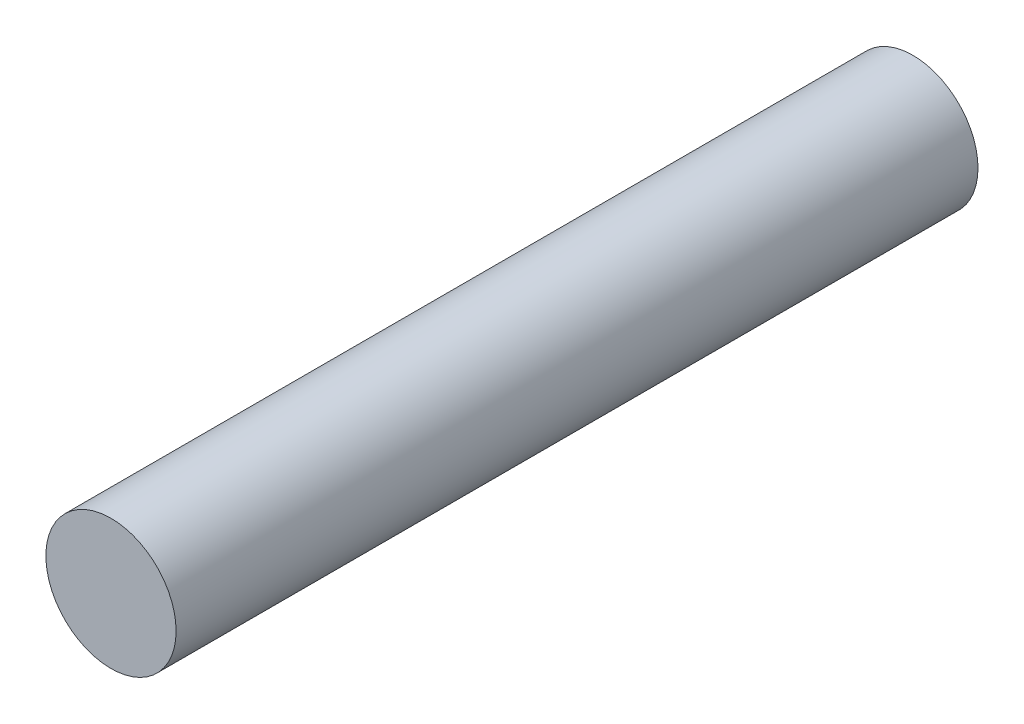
from build123d import *

# Parameters (mm, degrees)
ESQUISSE1_R        = 3.8
BOSS_EXTRU_1_DEPTH = 46.8


with BuildPart() as part:
    # Esquisse1 → Boss.-Extru.1 (new body)
    with BuildSketch(Plane.XY):
        Circle(ESQUISSE1_R)
    extrude(amount=BOSS_EXTRU_1_DEPTH)


solid = part.part
